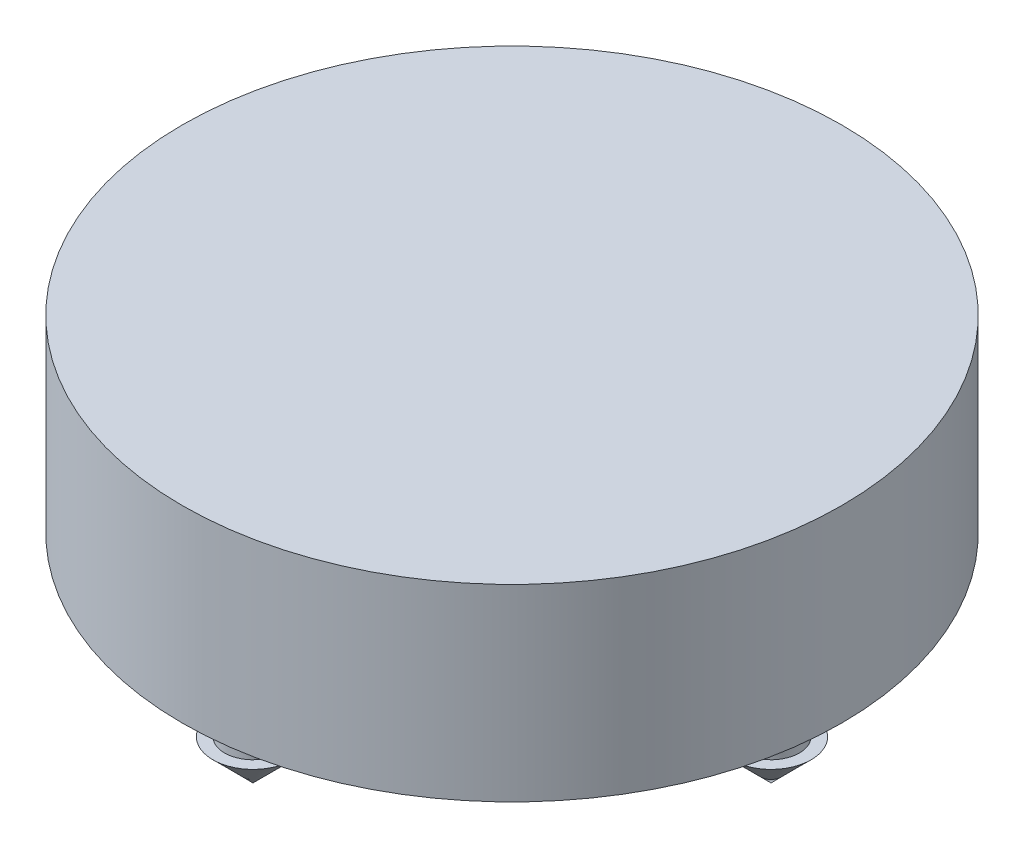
from build123d import *

# Parameters (mm, degrees)
SKETCH2_R           = 10
BOSS_EXTRUDE2_DEPTH = 18
BOSS_EXTRUDE2_TAPER = 10
CUT_EXTRUDE6_START  = -15
SKETCH8_W           = 7
SKETCH8_H           = 4
CUT_EXTRUDE6_DEPTH  = 31
SKETCH10_W          = 1.812938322
SKETCH10_H          = 33.120988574
CUT_EXTRUDE8_DEPTH  = 18
SKETCH15_R          = 3
BOSS_EXTRUDE8_DEPTH = 5
CIRPATTERN1_COUNT   = 4
CIRPATTERN2_COUNT   = 4


with BuildPart() as part:
    # Sketch1 → Revolve1 (revolve)
    with BuildSketch(Plane.XY):
        Polygon((0, 20), (35, 20), (35, 0), (20, 0), (20, 15), (0, 15), align=None)
    revolve(axis=Axis((0, 0, 0), (0, 1, 0)))

    # Sketch2 → Boss-Extrude2 (add)
    with BuildSketch(Plane.XZ.offset(-15)):
        Circle(SKETCH2_R)
    extrude(amount=BOSS_EXTRUDE2_DEPTH, taper=BOSS_EXTRUDE2_TAPER)

    # Sketch8 → Cut-Extrude6 (cut)
    with BuildSketch(Plane.XY.offset(CUT_EXTRUDE6_START)):
        with Locations((0, 10.643200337)):
            Rectangle(SKETCH8_W, SKETCH8_H)
    extrude(amount=-CUT_EXTRUDE6_DEPTH, mode=Mode.SUBTRACT)

    # Sketch10 → Cut-Extrude8 (cut)
    with BuildSketch(Plane.XZ.offset(-15)):
        Rectangle(SKETCH10_W, SKETCH10_H)
    extrude(amount=CUT_EXTRUDE8_DEPTH, mode=Mode.SUBTRACT)

    # Sketch15 → Boss-Extrude8 (add)
    with BuildSketch(Plane.XZ):
        with Locations((27.5, 0)):
            Circle(SKETCH15_R)
    boss_extrude8 = extrude(amount=BOSS_EXTRUDE8_DEPTH)

    # CirPattern1: Boss-Extrude8 ×4 about axis
    cirpattern1_axis = Axis((0, 0, 0), (0, 1, 0))
    for i in range(1, CIRPATTERN1_COUNT):
        add(boss_extrude8.rotate(cirpattern1_axis, i * 360 / CIRPATTERN1_COUNT))

    # Boss-Extrude9 cone 1 section (on through the dimple's axis) → Boss-Extrude9 (revolve)
    with BuildSketch(Plane(origin=(0, -5, 27.5), x_dir=(0, 0, 1), z_dir=(1, 0, 0))):
        Polygon((0, 0), (4.25, 0), (0, 4.25), align=None)
    boss_extrude9 = revolve(axis=Axis((0, -5, 27.5), (0, -1, 0)))

    # CirPattern2: Boss-Extrude9 ×4 about axis
    cirpattern2_axis = Axis((0, 0, 0), (0, 1, 0))
    for i in range(1, CIRPATTERN2_COUNT):
        add(boss_extrude9.rotate(cirpattern2_axis, i * 360 / CIRPATTERN2_COUNT))


solid = part.part
